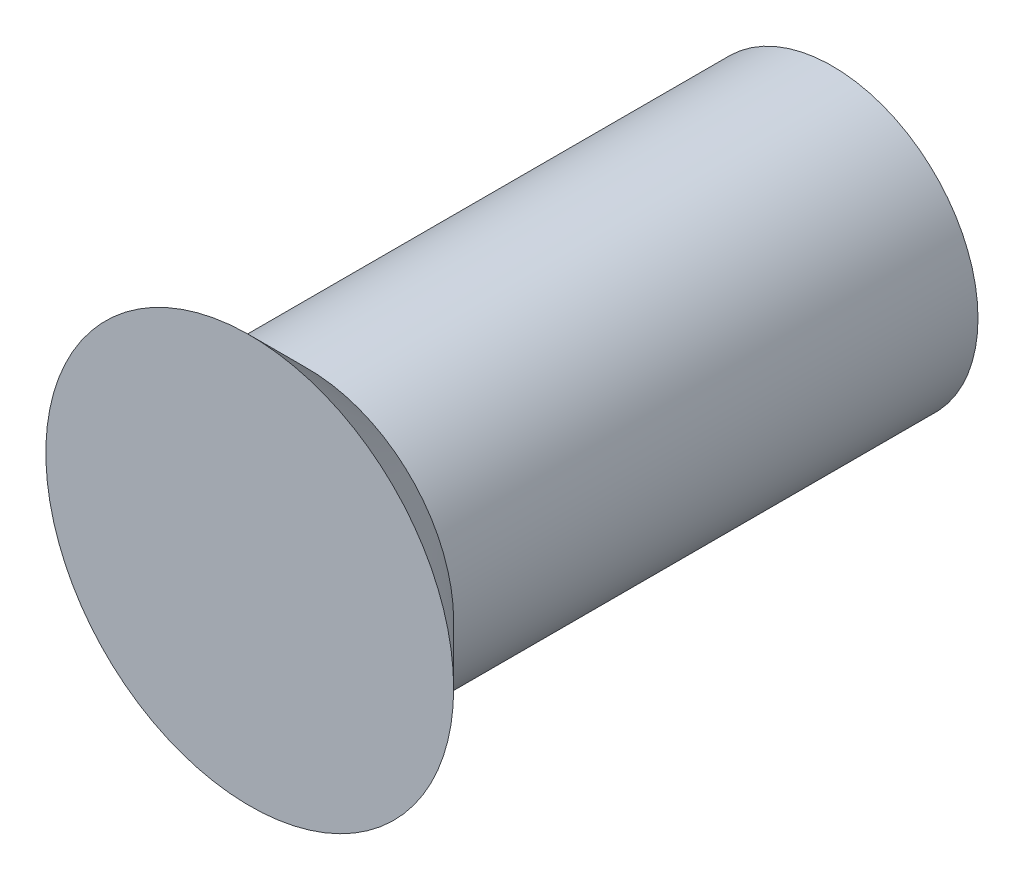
from build123d import *

# Parameters (mm, degrees)
IZIM1_R                     = 2.5
Y_KSEKLIK_EKSTR_ZYON1_DEPTH = 9
IZIM2_R                     = 2.5
Y_KSEKLIK_EKSTR_ZYON2_DEPTH = 1
Y_KSEKLIK_EKSTR_ZYON2_DRAFT = -45


with BuildPart() as part:
    # izim1 → Y_kseklik-Ekstr_zyon1 (new body)
    with BuildSketch(Plane.XY):
        Circle(IZIM1_R)
    extrude(amount=Y_KSEKLIK_EKSTR_ZYON1_DEPTH)


with BuildPart() as y_kseklik_ekstr_zyon2_tool:
    # izim2 → Y_kseklik-Ekstr_zyon2 (with draft: the straight prism first)
    with BuildSketch(Plane.XY.offset(9)):
        Circle(IZIM2_R)
    extrude(amount=Y_KSEKLIK_EKSTR_ZYON2_DEPTH)
    # Y_kseklik-Ekstr_zyon2: the draft: its side faces are tilted about the plane it starts from
    y_kseklik_ekstr_zyon2_sides = [y_kseklik_ekstr_zyon2_tool.faces().sort_by_distance(p)[0] for p in [
        (-2.5, 0, 9.5),
    ]]
    draft(y_kseklik_ekstr_zyon2_sides, Plane.XY.offset(9), Y_KSEKLIK_EKSTR_ZYON2_DRAFT)


with BuildPart() as part_1:
    add(part.part)

    # Y_kseklik-Ekstr_zyon2: add y_kseklik_ekstr_zyon2_tool
    add(y_kseklik_ekstr_zyon2_tool.part)


solid = part_1.part
